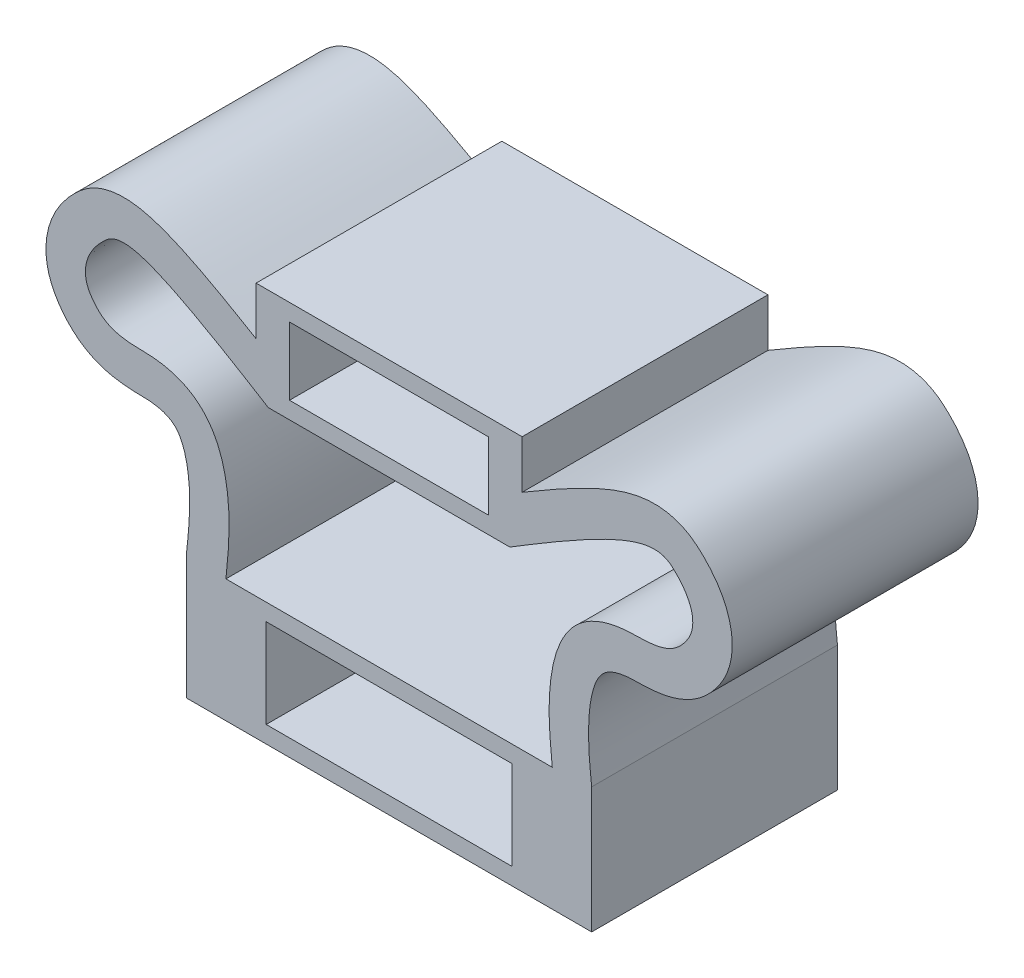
from build123d import *

# Parameters (mm, degrees)
EXTRUDE_1_DEPTH = 5.8


with BuildPart() as part:
    # Model → Extrude 1 (new body)
    with BuildSketch(Plane.XY):
        with BuildLine():
            Line((3.85, 0), (0, 0))
            add(Edge.make_bspline(
                [(0, 0), (0.035320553, 0.356346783), (0.070641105, 0.712693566), (0.074544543, 1.070370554), (0.077301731, 1.323015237), (0.064384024, 1.576323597), (0.02973389, 1.826930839), (0.00427903, 2.011033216), (-0.032904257, 2.193677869), (-0.088436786, 2.371007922), (-0.131104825, 2.507258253), (-0.184605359, 2.640371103), (-0.251958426, 2.766305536), (-0.306428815, 2.868152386), (-0.369959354, 2.965304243), (-0.443142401, 3.054642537), (-0.505542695, 3.130817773), (-0.574960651, 3.201312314), (-0.650512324, 3.264441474), (-0.718023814, 3.32085245), (-0.790432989, 3.371382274), (-0.866476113, 3.415577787), (-0.936876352, 3.456493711), (-1.010391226, 3.491980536), (-1.085945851, 3.522283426), (-1.157544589, 3.550999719), (-1.230975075, 3.575060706), (-1.305488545, 3.594955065), (-1.377080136, 3.614069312), (-1.449671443, 3.629337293), (-1.522787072, 3.641318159), (-1.593558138, 3.65291484), (-1.664820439, 3.661431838), (-1.73628896, 3.667197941), (-1.805714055, 3.67279918), (-1.875333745, 3.675804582), (-1.944972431, 3.677042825), (-2.009415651, 3.678188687), (-2.073875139, 3.677821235), (-2.138280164, 3.679924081), (-2.191574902, 3.681664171), (-2.244832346, 3.685095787), (-2.297927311, 3.690217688), (-2.342826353, 3.694548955), (-2.387609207, 3.700088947), (-2.432115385, 3.707401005), (-2.470782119, 3.713753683), (-2.509240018, 3.721443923), (-2.547295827, 3.7308034), (-2.581268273, 3.739158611), (-2.614920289, 3.748844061), (-2.64804113, 3.760114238), (-2.678446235, 3.77046032), (-2.7084037, 3.782141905), (-2.737707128, 3.795291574), (-2.765393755, 3.807715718), (-2.792496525, 3.821450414), (-2.818839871, 3.836515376), (-2.844463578, 3.851168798), (-2.869368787, 3.867080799), (-2.89343698, 3.884169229), (-2.917520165, 3.901268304), (-2.940765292, 3.919545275), (-2.963123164, 3.938842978), (-2.986096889, 3.95867224), (-3.008133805, 3.979579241), (-3.029274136, 4.001353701), (-3.051526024, 4.02427306), (-3.072784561, 4.048153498), (-3.093109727, 4.072785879), (-3.114966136, 4.099273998), (-3.135743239, 4.126631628), (-3.155769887, 4.15455479), (-3.177388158, 4.184697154), (-3.198131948, 4.215498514), (-3.216555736, 4.247675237), (-3.235030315, 4.279940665), (-3.251172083, 4.313589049), (-3.264738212, 4.348238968), (-3.278272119, 4.382806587), (-3.289242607, 4.418370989), (-3.297455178, 4.45456496), (-3.305732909, 4.491046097), (-3.311208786, 4.528166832), (-3.313899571, 4.565480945), (-3.316639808, 4.603480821), (-3.316491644, 4.641681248), (-3.31364777, 4.679669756), (-3.310726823, 4.718687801), (-3.304962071, 4.757482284), (-3.29668566, 4.795720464), (-3.288138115, 4.835211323), (-3.276911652, 4.874108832), (-3.263409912, 4.912186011), (-3.249437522, 4.951590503), (-3.233028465, 4.990116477), (-3.214604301, 5.027642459), (-3.195559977, 5.066431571), (-3.174362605, 5.104152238), (-3.151393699, 5.140744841), (-3.127738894, 5.178430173), (-3.102205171, 5.214919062), (-3.075180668, 5.250275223), (-3.04750006, 5.286489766), (-3.018255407, 5.321515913), (-2.98757112, 5.355179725), (-2.956345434, 5.389437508), (-2.923628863, 5.422284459), (-2.890295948, 5.45459273), (-2.856716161, 5.487140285), (-2.822510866, 5.519141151), (-2.784950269, 5.54697946), (-2.748875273, 5.573716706), (-2.709705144, 5.59661416), (-2.668287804, 5.614065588), (-2.626247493, 5.631779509), (-2.581891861, 5.643882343), (-2.536880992, 5.651373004), (-2.487738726, 5.659551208), (-2.43781542, 5.66223171), (-2.388057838, 5.661061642), (-2.331155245, 5.659723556), (-2.274469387, 5.653349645), (-2.218377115, 5.643825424), (-2.152565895, 5.632650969), (-2.08757178, 5.617139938), (-2.023359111, 5.598991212), (-1.946909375, 5.577383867), (-1.871567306, 5.552037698), (-1.797084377, 5.524440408), (-1.707461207, 5.491233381), (-1.619081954, 5.454767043), (-1.531582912, 5.416334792), (-1.425188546, 5.369603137), (-1.320095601, 5.319964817), (-1.215877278, 5.268576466), (-1.087555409, 5.20530305), (-0.960559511, 5.139376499), (-0.834429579, 5.071849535), (-0.67661355, 4.987358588), (-0.520153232, 4.900362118), (-0.364510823, 4.811934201), (-0.165627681, 4.69893915), (0.031919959, 4.583606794), (0.228492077, 4.466649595), (0.48678424, 4.312969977), (0.74339212, 4.156484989), (1, 4)],
                knots=[0, 0, 0, 0, 1.072963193, 1.072963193, 1.072963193, 1.830849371, 1.830849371, 1.830849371, 2.387611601, 2.387611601, 2.387611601, 2.815396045, 2.815396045, 2.815396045, 3.161357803, 3.161357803, 3.161357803, 3.456345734, 3.456345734, 3.456345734, 3.719941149, 3.719941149, 3.719941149, 3.963976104, 3.963976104, 3.963976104, 4.195233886, 4.195233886, 4.195233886, 4.417423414, 4.417423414, 4.417423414, 4.6324881, 4.6324881, 4.6324881, 4.841403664, 4.841403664, 4.841403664, 5.034732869, 5.034732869, 5.034732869, 5.194711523, 5.194711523, 5.194711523, 5.32999532, 5.32999532, 5.32999532, 5.447529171, 5.447529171, 5.447529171, 5.55245172, 5.55245172, 5.55245172, 5.648771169, 5.648771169, 5.648771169, 5.739776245, 5.739776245, 5.739776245, 5.828295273, 5.828295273, 5.828295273, 5.91686944, 5.91686944, 5.91686944, 6.007883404, 6.007883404, 6.007883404, 6.103682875, 6.103682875, 6.103682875, 6.206699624, 6.206699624, 6.206699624, 6.317903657, 6.317903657, 6.317903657, 6.429414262, 6.429414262, 6.429414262, 6.54066001, 6.54066001, 6.54066001, 6.652788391, 6.652788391, 6.652788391, 6.76697748, 6.76697748, 6.76697748, 6.884261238, 6.884261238, 6.884261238, 7.005387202, 7.005387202, 7.005387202, 7.130735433, 7.130735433, 7.130735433, 7.260302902, 7.260302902, 7.260302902, 7.393739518, 7.393739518, 7.393739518, 7.530415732, 7.530415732, 7.530415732, 7.669503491, 7.669503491, 7.669503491, 7.80962137, 7.80962137, 7.80962137, 7.944197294, 7.944197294, 7.944197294, 8.080797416, 8.080797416, 8.080797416, 8.22993561, 8.22993561, 8.22993561, 8.400489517, 8.400489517, 8.400489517, 8.600594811, 8.600594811, 8.600594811, 8.838834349, 8.838834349, 8.838834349, 9.125501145, 9.125501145, 9.125501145, 9.474073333, 9.474073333, 9.474073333, 9.903263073, 9.903263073, 9.903263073, 10.440272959, 10.440272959, 10.440272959, 11.126475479, 11.126475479, 11.126475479, 12.028133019, 12.028133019, 12.028133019, 12.028133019], degree=3))
            Line((1, 4), (3.85, 4))
            Line((3.85, 4), (3.85, 4.4))
            Line((3.85, 4.4), (1.5, 4.4))
            Line((1.5, 4.4), (1.5, 6))
            Line((1.5, 6), (3.85, 6))
            Line((3.85, 6), (3.85, 6.4))
            Line((3.85, 6.4), (0.710978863, 6.4))
            Line((0.710978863, 6.4), (0.710978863, 5.264341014))
            add(Edge.make_bspline(
                [(0.710978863, 5.264341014), (0.509395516, 5.38303578), (0.307812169, 5.501730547), (0.10458445, 5.617573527), (-0.05688168, 5.709611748), (-0.219385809, 5.799849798), (-0.38321225, 5.887636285), (-0.517279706, 5.959476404), (-0.652232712, 6.029674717), (-0.788559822, 6.097132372), (-0.903402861, 6.153959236), (-1.019221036, 6.208841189), (-1.136402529, 6.260691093), (-1.238303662, 6.305779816), (-1.341235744, 6.348575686), (-1.44551826, 6.387867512), (-1.539728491, 6.423364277), (-1.635040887, 6.456001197), (-1.731633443, 6.484429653), (-1.823135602, 6.511359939), (-1.915786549, 6.534513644), (-2.0095018, 6.552382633), (-2.103405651, 6.570287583), (-2.198378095, 6.582886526), (-2.293843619, 6.588546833), (-2.394986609, 6.594543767), (-2.496683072, 6.592752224), (-2.597444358, 6.581661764), (-2.707955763, 6.569498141), (-2.817342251, 6.546148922), (-2.922900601, 6.510880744), (-3.037627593, 6.472549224), (-3.147832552, 6.420138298), (-3.249681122, 6.355144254), (-3.340866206, 6.296955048), (-3.425353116, 6.228679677), (-3.504980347, 6.155497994), (-3.556619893, 6.10803849), (-3.606215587, 6.058515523), (-3.65390277, 6.007182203), (-3.701552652, 5.955889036), (-3.747297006, 5.902788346), (-3.790726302, 5.847853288), (-3.835247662, 5.791536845), (-3.877336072, 5.73329262), (-3.916630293, 5.673208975), (-3.956981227, 5.61150954), (-3.994385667, 5.547870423), (-4.028393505, 5.482452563), (-4.063384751, 5.41514301), (-4.094780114, 5.345950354), (-4.122099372, 5.275170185), (-4.150243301, 5.202253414), (-4.174061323, 5.12765184), (-4.193074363, 5.05183058), (-4.21264371, 4.973790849), (-4.227122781, 4.894459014), (-4.236104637, 4.814497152), (-4.245308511, 4.732558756), (-4.248740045, 4.649958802), (-4.246155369, 4.567536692), (-4.243529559, 4.483802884), (-4.234694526, 4.400252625), (-4.219633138, 4.317842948), (-4.204517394, 4.235135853), (-4.183130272, 4.153577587), (-4.155767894, 4.074065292), (-4.128681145, 3.995353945), (-4.095738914, 3.918647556), (-4.057295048, 3.84485703), (-4.02129768, 3.775762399), (-3.980476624, 3.709224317), (-3.936427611, 3.644968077), (-3.903730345, 3.597271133), (-3.869254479, 3.550831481), (-3.833083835, 3.505737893), (-3.798437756, 3.462544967), (-3.762236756, 3.420587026), (-3.724405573, 3.380147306), (-3.68576833, 3.338845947), (-3.645430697, 3.299128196), (-3.603421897, 3.261257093), (-3.560297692, 3.222380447), (-3.515412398, 3.185449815), (-3.468887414, 3.150710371), (-3.421150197, 3.115065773), (-3.371686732, 3.081728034), (-3.320717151, 3.05087914), (-3.268620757, 3.019348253), (-3.214950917, 2.99041747), (-3.16000469, 2.964165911), (-3.104052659, 2.937433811), (-3.046777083, 2.91347992), (-2.988516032, 2.892253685), (-2.92916406, 2.870629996), (-2.868789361, 2.851837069), (-2.807728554, 2.835661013), (-2.745021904, 2.819048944), (-2.681591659, 2.80519672), (-2.617739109, 2.793809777), (-2.550987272, 2.7819058), (-2.48377391, 2.772696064), (-2.416339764, 2.765510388), (-2.343840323, 2.757784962), (-2.271085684, 2.752399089), (-2.198265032, 2.74959784), (-2.118520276, 2.746530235), (-2.038696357, 2.746562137), (-1.958866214, 2.744888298), (-1.899232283, 2.743637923), (-1.83959488, 2.741435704), (-1.78022045, 2.73597556), (-1.731543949, 2.731499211), (-1.683044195, 2.724833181), (-1.63497023, 2.715834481), (-1.589454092, 2.707314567), (-1.544319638, 2.696703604), (-1.500017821, 2.683218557), (-1.4586816, 2.67063621), (-1.418070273, 2.655551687), (-1.378903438, 2.637251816), (-1.342381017, 2.620187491), (-1.307114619, 2.60032734), (-1.274111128, 2.577163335), (-1.242027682, 2.554645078), (-1.212082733, 2.529004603), (-1.185036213, 2.500642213), (-1.15545812, 2.469625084), (-1.129346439, 2.435352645), (-1.106175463, 2.399285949), (-1.076028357, 2.352360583), (-1.050859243, 2.30239792), (-1.028935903, 2.25112489), (-0.996220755, 2.174612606), (-0.97073335, 2.095182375), (-0.949897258, 2.01465002), (-0.917168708, 1.888152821), (-0.895916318, 1.758936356), (-0.881283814, 1.629062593), (-0.858331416, 1.425343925), (-0.851667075, 1.220007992), (-0.856082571, 1.015250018), (-0.862934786, 0.697495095), (-0.896470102, 0.381132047), (-0.930005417, 0.064768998)],
                knots=[-13.036879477, -13.036879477, -13.036879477, -13.036879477, -12.335105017, -12.335105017, -12.335105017, -11.777539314, -11.777539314, -11.777539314, -11.321255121, -11.321255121, -11.321255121, -10.936877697, -10.936877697, -10.936877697, -10.60262274, -10.60262274, -10.60262274, -10.300652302, -10.300652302, -10.300652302, -10.01459561, -10.01459561, -10.01459561, -9.727963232, -9.727963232, -9.727963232, -9.424284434, -9.424284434, -9.424284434, -9.091220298, -9.091220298, -9.091220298, -8.729226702, -8.729226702, -8.729226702, -8.405133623, -8.405133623, -8.405133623, -8.19495403, -8.19495403, -8.19495403, -7.984938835, -7.984938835, -7.984938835, -7.769642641, -7.769642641, -7.769642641, -7.54855663, -7.54855663, -7.54855663, -7.321077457, -7.321077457, -7.321077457, -7.086731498, -7.086731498, -7.086731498, -6.845528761, -6.845528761, -6.845528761, -6.598363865, -6.598363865, -6.598363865, -6.347265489, -6.347265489, -6.347265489, -6.095260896, -6.095260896, -6.095260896, -5.845794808, -5.845794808, -5.845794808, -5.612204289, -5.612204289, -5.612204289, -5.438811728, -5.438811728, -5.438811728, -5.272727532, -5.272727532, -5.272727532, -5.103104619, -5.103104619, -5.103104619, -4.928977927, -4.928977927, -4.928977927, -4.750314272, -4.750314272, -4.750314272, -4.567700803, -4.567700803, -4.567700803, -4.38174455, -4.38174455, -4.38174455, -4.19230632, -4.19230632, -4.19230632, -3.997761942, -3.997761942, -3.997761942, -3.794384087, -3.794384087, -3.794384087, -3.57572957, -3.57572957, -3.57572957, -3.336284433, -3.336284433, -3.336284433, -3.157416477, -3.157416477, -3.157416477, -3.010776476, -3.010776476, -3.010776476, -2.871938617, -2.871938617, -2.871938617, -2.742394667, -2.742394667, -2.742394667, -2.621597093, -2.621597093, -2.621597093, -2.504167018, -2.504167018, -2.504167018, -2.375745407, -2.375745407, -2.375745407, -2.208659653, -2.208659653, -2.208659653, -1.959325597, -1.959325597, -1.959325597, -1.567681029, -1.567681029, -1.567681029, -0.953351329, -0.953351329, -0.953351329, 0, 0, 0, 0], degree=3))
            Line((-0.930005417, 0.064768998), (-0.930005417, -2.9))
            Line((-0.930005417, -2.9), (3.85, -2.9))
            Line((3.85, -2.9), (3.85, -2.5))
            Line((3.85, -2.5), (0.95, -2.5))
            Line((0.95, -2.5), (0.95, -0.4))
            Line((0.95, -0.4), (3.85, -0.4))
            Line((3.85, -0.4), (3.85, 0))
        make_face()
    extrude_1 = extrude(amount=EXTRUDE_1_DEPTH)

    # Mirror 1: Extrude 1 across plane
    add(extrude_1.mirror(Plane(origin=(3.85, 0, 0), x_dir=(0, 0, 1), z_dir=(1, 0, 0))))


solid = part.part
